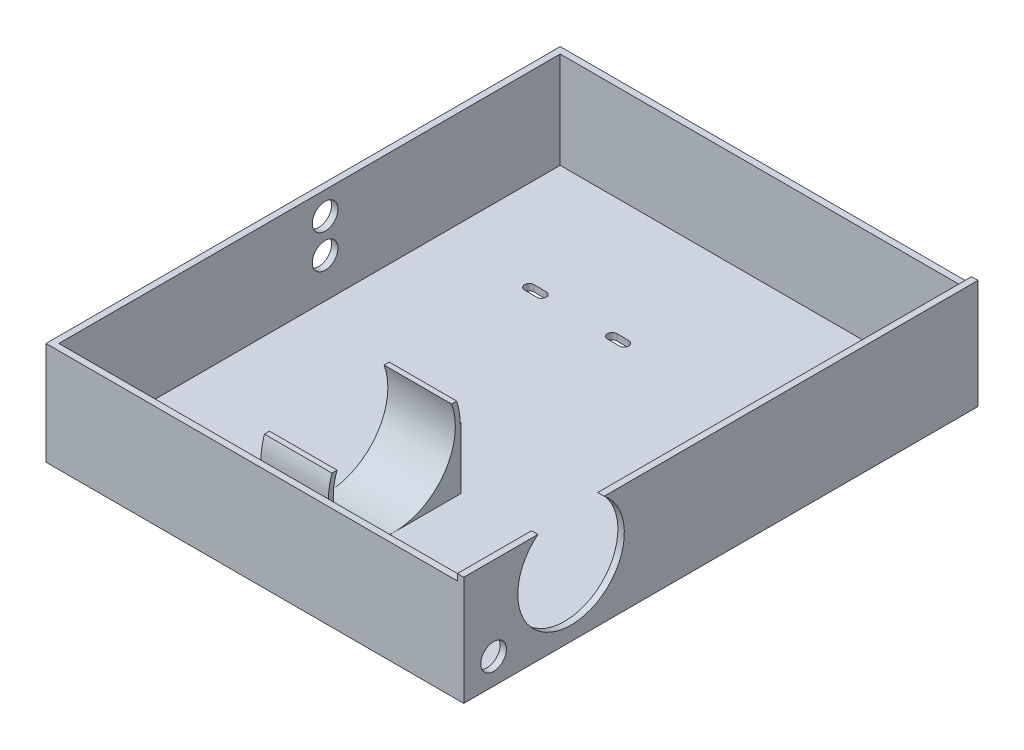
ISO-10303-21;
HEADER;
FILE_DESCRIPTION(('STEP AP214'),'2;1');
FILE_NAME('part.step','',(''),(''),'','','');
FILE_SCHEMA(('AUTOMOTIVE_DESIGN { 1 0 10303 214 1 1 1 1 }'));
ENDSEC;
DATA;
#1=APPLICATION_CONTEXT('core data for automotive mechanical design processes');
#2=APPLICATION_PROTOCOL_DEFINITION('international standard','automotive_design',2000,#1);
#3=PRODUCT_CONTEXT('',#1,'mechanical');
#4=PRODUCT('Part','Part','',(#3));
#5=PRODUCT_RELATED_PRODUCT_CATEGORY('part','',(#4));
#6=PRODUCT_DEFINITION_FORMATION('','',#4);
#7=PRODUCT_DEFINITION_CONTEXT('part definition',#1,'design');
#8=PRODUCT_DEFINITION('design','',#6,#7);
#9=PRODUCT_DEFINITION_SHAPE('','',#8);
#10=(LENGTH_UNIT() NAMED_UNIT(*) SI_UNIT(.MILLI.,.METRE.));
#11=(NAMED_UNIT(*) PLANE_ANGLE_UNIT() SI_UNIT($,.RADIAN.));
#12=(NAMED_UNIT(*) SI_UNIT($,.STERADIAN.) SOLID_ANGLE_UNIT());
#13=UNCERTAINTY_MEASURE_WITH_UNIT(LENGTH_MEASURE(1.E-05),#10,'distance_accuracy_value','');
#14=(GEOMETRIC_REPRESENTATION_CONTEXT(3) GLOBAL_UNCERTAINTY_ASSIGNED_CONTEXT((#13)) GLOBAL_UNIT_ASSIGNED_CONTEXT((#10,
#11,#12)) REPRESENTATION_CONTEXT('',''));
#15=CARTESIAN_POINT('',(0.,0.,0.));
#16=DIRECTION('',(0.,0.,1.));
#17=DIRECTION('',(1.,0.,0.));
#18=AXIS2_PLACEMENT_3D('',#15,#16,#17);
#19=CARTESIAN_POINT('',(0.,2.,0.));
#20=DIRECTION('',(0.,-1.,0.));
#21=DIRECTION('',(0.,0.,-1.));
#22=AXIS2_PLACEMENT_3D('',#19,#20,#21);
#23=PLANE('',#22);
#24=DIRECTION('',(0.,0.,1.));
#25=VECTOR('',#24,1.);
#26=CARTESIAN_POINT('',(54.,2.,0.));
#27=LINE('',#26,#25);
#28=CARTESIAN_POINT('',(54.,2.,-54.1969807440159));
#29=VERTEX_POINT('',#28);
#30=CARTESIAN_POINT('',(54.,2.00000000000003,-33.3714284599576));
#31=VERTEX_POINT('',#30);
#32=EDGE_CURVE('E314',#29,#31,#27,.T.);
#33=ORIENTED_EDGE('',*,*,#32,.F.);
#34=DIRECTION('',(1.,0.,0.));
#35=VECTOR('',#34,1.);
#36=CARTESIAN_POINT('',(54.,2.,-54.1969807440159));
#37=LINE('',#36,#35);
#38=CARTESIAN_POINT('',(75.,2.,-54.1969807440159));
#39=VERTEX_POINT('',#38);
#40=EDGE_CURVE('E382',#29,#39,#37,.T.);
#41=ORIENTED_EDGE('',*,*,#40,.T.);
#42=DIRECTION('',(0.,0.,1.));
#43=VECTOR('',#42,1.);
#44=CARTESIAN_POINT('',(75.,2.,0.));
#45=LINE('',#44,#43);
#46=CARTESIAN_POINT('',(75.,2.00000000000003,-33.3714284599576));
#47=VERTEX_POINT('',#46);
#48=EDGE_CURVE('E316',#39,#47,#45,.T.);
#49=ORIENTED_EDGE('',*,*,#48,.T.);
#50=CARTESIAN_POINT('',(75.,2.,-12.8714284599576));
#51=VERTEX_POINT('',#50);
#52=EDGE_CURVE('E313',#47,#51,#45,.T.);
#53=ORIENTED_EDGE('',*,*,#52,.T.);
#54=DIRECTION('',(1.,0.,0.));
#55=VECTOR('',#54,1.);
#56=CARTESIAN_POINT('',(54.,2.,-12.8714284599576));
#57=LINE('',#56,#55);
#58=CARTESIAN_POINT('',(54.,2.,-12.8714284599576));
#59=VERTEX_POINT('',#58);
#60=EDGE_CURVE('E394',#59,#51,#57,.T.);
#61=ORIENTED_EDGE('',*,*,#60,.F.);
#62=EDGE_CURVE('E311',#31,#59,#27,.T.);
#63=ORIENTED_EDGE('',*,*,#62,.F.);
#64=EDGE_LOOP('',(#33,#41,#49,#53,#61,#63));
#65=FACE_BOUND('',#64,.T.);
#66=DIRECTION('',(-0.999931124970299,0.,-0.0117364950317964));
#67=VECTOR('',#66,1.);
#68=CARTESIAN_POINT('',(33.9153525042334,2.,-121.75040197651));
#69=LINE('',#68,#67);
#70=CARTESIAN_POINT('',(33.9153525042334,2.,-121.75040197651));
#71=VERTEX_POINT('',#70);
#72=CARTESIAN_POINT('',(30.0909049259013,2.,-121.795290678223));
#73=VERTEX_POINT('',#72);
#74=EDGE_CURVE('E427',#71,#73,#69,.T.);
#75=ORIENTED_EDGE('',*,*,#74,.F.);
#76=CARTESIAN_POINT('',(33.8980985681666,2.,-120.280393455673));
#77=DIRECTION('',(0.,1.,0.));
#78=DIRECTION('',(0.,0.,1.));
#79=AXIS2_PLACEMENT_3D('',#76,#77,#78);
#80=CIRCLE('',#79,1.47010977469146);
#81=CARTESIAN_POINT('',(33.8808446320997,2.,-118.810384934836));
#82=VERTEX_POINT('',#81);
#83=EDGE_CURVE('E425',#82,#71,#80,.T.);
#84=ORIENTED_EDGE('',*,*,#83,.F.);
#85=DIRECTION('',(0.999931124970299,0.,0.0117364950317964));
#86=VECTOR('',#85,1.);
#87=CARTESIAN_POINT('',(33.8808446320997,2.,-118.810384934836));
#88=LINE('',#87,#86);
#89=CARTESIAN_POINT('',(30.0563970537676,2.,-118.855273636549));
#90=VERTEX_POINT('',#89);
#91=EDGE_CURVE('E434',#90,#82,#88,.T.);
#92=ORIENTED_EDGE('',*,*,#91,.F.);
#93=CARTESIAN_POINT('',(30.0736509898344,2.,-120.325282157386));
#94=DIRECTION('',(0.,1.,0.));
#95=DIRECTION('',(0.,0.,1.));
#96=AXIS2_PLACEMENT_3D('',#93,#94,#95);
#97=CIRCLE('',#96,1.47010977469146);
#98=EDGE_CURVE('E431',#73,#90,#97,.T.);
#99=ORIENTED_EDGE('',*,*,#98,.F.);
#100=EDGE_LOOP('',(#75,#84,#92,#99));
#101=FACE_BOUND('',#100,.T.);
#102=DIRECTION('',(-0.999931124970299,0.,-0.011736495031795));
#103=VECTOR('',#102,1.);
#104=CARTESIAN_POINT('',(59.9121793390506,2.,-121.440400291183));
#105=LINE('',#104,#103);
#106=CARTESIAN_POINT('',(59.9121793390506,2.,-121.440400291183));
#107=VERTEX_POINT('',#106);
#108=CARTESIAN_POINT('',(56.1906892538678,2.,-121.484080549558));
#109=VERTEX_POINT('',#108);
#110=EDGE_CURVE('E461',#107,#109,#105,.T.);
#111=ORIENTED_EDGE('',*,*,#110,.F.);
#112=CARTESIAN_POINT('',(59.8949825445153,2.,-119.975260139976));
#113=DIRECTION('',(0.,1.,0.));
#114=DIRECTION('',(0.,0.,1.));
#115=AXIS2_PLACEMENT_3D('',#112,#113,#114);
#116=CIRCLE('',#115,1.46524106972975);
#117=CARTESIAN_POINT('',(59.87778574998,2.,-118.510119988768));
#118=VERTEX_POINT('',#117);
#119=EDGE_CURVE('E428',#118,#107,#116,.T.);
#120=ORIENTED_EDGE('',*,*,#119,.F.);
#121=DIRECTION('',(0.999931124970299,0.,0.0117364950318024));
#122=VECTOR('',#121,1.);
#123=CARTESIAN_POINT('',(59.87778574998,2.,-118.510119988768));
#124=LINE('',#123,#122);
#125=CARTESIAN_POINT('',(56.1562956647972,2.,-118.553800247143));
#126=VERTEX_POINT('',#125);
#127=EDGE_CURVE('E450',#126,#118,#124,.T.);
#128=ORIENTED_EDGE('',*,*,#127,.F.);
#129=CARTESIAN_POINT('',(56.1734924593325,2.,-120.01894039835));
#130=DIRECTION('',(0.,1.,0.));
#131=DIRECTION('',(0.,0.,1.));
#132=AXIS2_PLACEMENT_3D('',#129,#130,#131);
#133=CIRCLE('',#132,1.46524106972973);
#134=EDGE_CURVE('E458',#109,#126,#133,.T.);
#135=ORIENTED_EDGE('',*,*,#134,.F.);
#136=EDGE_LOOP('',(#111,#120,#128,#135));
#137=FACE_BOUND('',#136,.T.);
#138=DIRECTION('',(1.,0.,0.));
#139=VECTOR('',#138,1.);
#140=CARTESIAN_POINT('',(2.,2.,-158.));
#141=LINE('',#140,#139);
#142=CARTESIAN_POINT('',(2.,2.,-158.));
#143=VERTEX_POINT('',#142);
#144=CARTESIAN_POINT('',(128.,2.,-158.));
#145=VERTEX_POINT('',#144);
#146=EDGE_CURVE('E252',#143,#145,#141,.T.);
#147=ORIENTED_EDGE('',*,*,#146,.F.);
#148=DIRECTION('',(0.,0.,-1.));
#149=VECTOR('',#148,1.);
#150=CARTESIAN_POINT('',(2.,2.,-160.));
#151=LINE('',#150,#149);
#152=CARTESIAN_POINT('',(2.00000000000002,2.,-1.99999999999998));
#153=VERTEX_POINT('',#152);
#154=EDGE_CURVE('E261',#153,#143,#151,.T.);
#155=ORIENTED_EDGE('',*,*,#154,.F.);
#156=DIRECTION('',(-1.,0.,0.));
#157=VECTOR('',#156,1.);
#158=CARTESIAN_POINT('',(128.,2.,-2.));
#159=LINE('',#158,#157);
#160=CARTESIAN_POINT('',(128.,2.,-2.));
#161=VERTEX_POINT('',#160);
#162=EDGE_CURVE('E262',#161,#153,#159,.T.);
#163=ORIENTED_EDGE('',*,*,#162,.F.);
#164=DIRECTION('',(0.,0.,1.));
#165=VECTOR('',#164,1.);
#166=CARTESIAN_POINT('',(128.,2.,0.));
#167=LINE('',#166,#165);
#168=EDGE_CURVE('E336',#145,#161,#167,.T.);
#169=ORIENTED_EDGE('',*,*,#168,.F.);
#170=EDGE_LOOP('',(#147,#155,#163,#169));
#171=FACE_BOUND('',#170,.T.);
#172=ADVANCED_FACE('F43',(#65,#101,#137,#171),#23,.F.);
#173=CARTESIAN_POINT('',(2.,32.,-160.));
#174=DIRECTION('',(-1.,0.,0.));
#175=DIRECTION('',(0.,0.,1.));
#176=AXIS2_PLACEMENT_3D('',#173,#174,#175);
#177=PLANE('',#176);
#178=CARTESIAN_POINT('',(2.00000000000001,24.843091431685,-84.8541135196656));
#179=DIRECTION('',(1.,0.,0.));
#180=DIRECTION('',(0.,0.,-1.));
#181=AXIS2_PLACEMENT_3D('',#178,#179,#180);
#182=CIRCLE('',#181,4.00000000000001);
#183=CARTESIAN_POINT('',(2.00000000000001,24.843091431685,-88.8541135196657));
#184=VERTEX_POINT('',#183);
#185=EDGE_CURVE('E465',#184,#184,#182,.T.);
#186=ORIENTED_EDGE('',*,*,#185,.F.);
#187=EDGE_LOOP('',(#186));
#188=FACE_BOUND('',#187,.T.);
#189=CARTESIAN_POINT('',(2.00000000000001,14.3099296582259,-84.8541135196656));
#190=DIRECTION('',(1.,0.,0.));
#191=DIRECTION('',(0.,0.,-1.));
#192=AXIS2_PLACEMENT_3D('',#189,#190,#191);
#193=CIRCLE('',#192,4.00000000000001);
#194=CARTESIAN_POINT('',(2.00000000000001,14.3099296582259,-88.8541135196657));
#195=VERTEX_POINT('',#194);
#196=EDGE_CURVE('E440',#195,#195,#193,.T.);
#197=ORIENTED_EDGE('',*,*,#196,.F.);
#198=EDGE_LOOP('',(#197));
#199=FACE_BOUND('',#198,.T.);
#200=CARTESIAN_POINT('',(2.00000000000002,14.4124588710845,-13.8608746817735));
#201=DIRECTION('',(-1.,0.,0.));
#202=DIRECTION('',(0.,0.,1.));
#203=AXIS2_PLACEMENT_3D('',#200,#201,#202);
#204=CIRCLE('',#203,3.90573086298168);
#205=CARTESIAN_POINT('',(2.00000000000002,14.4124588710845,-9.95514381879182));
#206=VERTEX_POINT('',#205);
#207=EDGE_CURVE('E277',#206,#206,#204,.T.);
#208=ORIENTED_EDGE('',*,*,#207,.T.);
#209=EDGE_LOOP('',(#208));
#210=FACE_BOUND('',#209,.T.);
#211=DIRECTION('',(0.,-1.,0.));
#212=VECTOR('',#211,1.);
#213=CARTESIAN_POINT('',(2.,32.,-158.));
#214=LINE('',#213,#212);
#215=CARTESIAN_POINT('',(2.,32.,-158.));
#216=VERTEX_POINT('',#215);
#217=EDGE_CURVE('E244',#216,#143,#214,.T.);
#218=ORIENTED_EDGE('',*,*,#217,.F.);
#219=DIRECTION('',(0.,0.,-1.));
#220=VECTOR('',#219,1.);
#221=CARTESIAN_POINT('',(2.,32.,-160.));
#222=LINE('',#221,#220);
#223=CARTESIAN_POINT('',(2.00000000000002,32.,-1.99999999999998));
#224=VERTEX_POINT('',#223);
#225=EDGE_CURVE('E259',#224,#216,#222,.T.);
#226=ORIENTED_EDGE('',*,*,#225,.F.);
#227=DIRECTION('',(0.,-1.,0.));
#228=VECTOR('',#227,1.);
#229=CARTESIAN_POINT('',(2.00000000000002,32.,-1.99999999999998));
#230=LINE('',#229,#228);
#231=EDGE_CURVE('E488',#224,#153,#230,.T.);
#232=ORIENTED_EDGE('',*,*,#231,.T.);
#233=ORIENTED_EDGE('',*,*,#154,.T.);
#234=EDGE_LOOP('',(#218,#226,#232,#233));
#235=FACE_BOUND('',#234,.T.);
#236=ADVANCED_FACE('F257',(#188,#199,#210,#235),#177,.F.);
#237=CARTESIAN_POINT('',(128.,34.,0.));
#238=DIRECTION('',(1.,0.,0.));
#239=DIRECTION('',(0.,0.,-1.));
#240=AXIS2_PLACEMENT_3D('',#237,#238,#239);
#241=PLANE('',#240);
#242=CARTESIAN_POINT('',(128.,8.,-9.27264860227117));
#243=DIRECTION('',(1.,0.,0.));
#244=DIRECTION('',(0.,0.,-1.));
#245=AXIS2_PLACEMENT_3D('',#242,#243,#244);
#246=CIRCLE('',#245,4.);
#247=CARTESIAN_POINT('',(128.,8.,-13.2726486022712));
#248=VERTEX_POINT('',#247);
#249=EDGE_CURVE('E47',#248,#248,#246,.T.);
#250=ORIENTED_EDGE('',*,*,#249,.T.);
#251=EDGE_LOOP('',(#250));
#252=FACE_BOUND('',#251,.T.);
#253=DIRECTION('',(0.,-1.,0.));
#254=VECTOR('',#253,1.);
#255=CARTESIAN_POINT('',(128.,32.,-158.));
#256=LINE('',#255,#254);
#257=CARTESIAN_POINT('',(128.,32.,-158.));
#258=VERTEX_POINT('',#257);
#259=EDGE_CURVE('E247',#258,#145,#256,.T.);
#260=ORIENTED_EDGE('',*,*,#259,.T.);
#261=ORIENTED_EDGE('',*,*,#168,.T.);
#262=DIRECTION('',(0.,-1.,0.));
#263=VECTOR('',#262,1.);
#264=CARTESIAN_POINT('',(128.,32.,-2.));
#265=LINE('',#264,#263);
#266=CARTESIAN_POINT('',(128.,32.,-2.));
#267=VERTEX_POINT('',#266);
#268=EDGE_CURVE('E486',#267,#161,#265,.T.);
#269=ORIENTED_EDGE('',*,*,#268,.F.);
#270=DIRECTION('',(0.,0.,-1.));
#271=VECTOR('',#270,1.);
#272=CARTESIAN_POINT('',(128.,32.,0.));
#273=LINE('',#272,#271);
#274=CARTESIAN_POINT('',(128.,32.,0.));
#275=VERTEX_POINT('',#274);
#276=EDGE_CURVE('E484',#275,#267,#273,.T.);
#277=ORIENTED_EDGE('',*,*,#276,.F.);
#278=DIRECTION('',(0.,-1.,0.));
#279=VECTOR('',#278,1.);
#280=CARTESIAN_POINT('',(128.,34.,0.));
#281=LINE('',#280,#279);
#282=CARTESIAN_POINT('',(128.,34.,0.));
#283=VERTEX_POINT('',#282);
#284=EDGE_CURVE('E345',#283,#275,#281,.T.);
#285=ORIENTED_EDGE('',*,*,#284,.F.);
#286=DIRECTION('',(0.,0.,1.));
#287=VECTOR('',#286,1.);
#288=CARTESIAN_POINT('',(128.,34.,0.));
#289=LINE('',#288,#287);
#290=CARTESIAN_POINT('',(128.,34.,-23.0840785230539));
#291=VERTEX_POINT('',#290);
#292=EDGE_CURVE('E335',#291,#283,#289,.T.);
#293=ORIENTED_EDGE('',*,*,#292,.F.);
#294=CARTESIAN_POINT('',(128.,21.0000000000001,-33.3714284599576));
#295=DIRECTION('',(1.,0.,0.));
#296=DIRECTION('',(0.,0.,-1.));
#297=AXIS2_PLACEMENT_3D('',#294,#295,#296);
#298=CIRCLE('',#297,16.5779844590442);
#299=CARTESIAN_POINT('',(128.,34.,-43.6587783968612));
#300=VERTEX_POINT('',#299);
#301=EDGE_CURVE('E323',#291,#300,#298,.T.);
#302=ORIENTED_EDGE('',*,*,#301,.T.);
#303=CARTESIAN_POINT('',(128.,34.,-160.));
#304=VERTEX_POINT('',#303);
#305=EDGE_CURVE('E333',#304,#300,#289,.T.);
#306=ORIENTED_EDGE('',*,*,#305,.F.);
#307=DIRECTION('',(0.,-1.,0.));
#308=VECTOR('',#307,1.);
#309=CARTESIAN_POINT('',(128.,34.,-160.));
#310=LINE('',#309,#308);
#311=CARTESIAN_POINT('',(128.,32.,-160.));
#312=VERTEX_POINT('',#311);
#313=EDGE_CURVE('E354',#304,#312,#310,.T.);
#314=ORIENTED_EDGE('',*,*,#313,.T.);
#315=DIRECTION('',(0.,0.,-1.));
#316=VECTOR('',#315,1.);
#317=CARTESIAN_POINT('',(128.,32.,-160.));
#318=LINE('',#317,#316);
#319=EDGE_CURVE('E251',#258,#312,#318,.T.);
#320=ORIENTED_EDGE('',*,*,#319,.F.);
#321=EDGE_LOOP('',(#260,#261,#269,#277,#285,#293,#302,#306,#314,#320));
#322=FACE_BOUND('',#321,.T.);
#323=ADVANCED_FACE('F331',(#252,#322),#241,.F.);
#324=CARTESIAN_POINT('',(0.,34.,0.));
#325=DIRECTION('',(0.,1.,0.));
#326=DIRECTION('',(0.,0.,1.));
#327=AXIS2_PLACEMENT_3D('',#324,#325,#326);
#328=PLANE('',#327);
#329=DIRECTION('',(1.,0.,0.));
#330=VECTOR('',#329,1.);
#331=CARTESIAN_POINT('',(98.,34.,-23.0840785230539));
#332=LINE('',#331,#330);
#333=CARTESIAN_POINT('',(130.,34.,-23.0840785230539));
#334=VERTEX_POINT('',#333);
#335=EDGE_CURVE('E11',#291,#334,#332,.T.);
#336=ORIENTED_EDGE('',*,*,#335,.F.);
#337=ORIENTED_EDGE('',*,*,#292,.T.);
#338=DIRECTION('',(1.,0.,0.));
#339=VECTOR('',#338,1.);
#340=CARTESIAN_POINT('',(130.,34.,0.));
#341=LINE('',#340,#339);
#342=CARTESIAN_POINT('',(130.,34.,0.));
#343=VERTEX_POINT('',#342);
#344=EDGE_CURVE('E342',#283,#343,#341,.T.);
#345=ORIENTED_EDGE('',*,*,#344,.T.);
#346=DIRECTION('',(0.,0.,-1.));
#347=VECTOR('',#346,1.);
#348=CARTESIAN_POINT('',(130.,34.,0.));
#349=LINE('',#348,#347);
#350=EDGE_CURVE('E498',#343,#334,#349,.T.);
#351=ORIENTED_EDGE('',*,*,#350,.T.);
#352=EDGE_LOOP('',(#336,#337,#345,#351));
#353=FACE_BOUND('',#352,.T.);
#354=ADVANCED_FACE('F645',(#353),#328,.T.);
#355=CARTESIAN_POINT('',(75.,21.0000000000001,-33.3714284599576));
#356=DIRECTION('',(-1.,0.,0.));
#357=DIRECTION('',(0.,0.,1.));
#358=AXIS2_PLACEMENT_3D('',#355,#356,#357);
#359=CYLINDRICAL_SURFACE('',#358,20.5);
#360=CARTESIAN_POINT('',(75.,21.0000000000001,-33.3714284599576));
#361=DIRECTION('',(1.,0.,0.));
#362=DIRECTION('',(0.,0.,-1.));
#363=AXIS2_PLACEMENT_3D('',#360,#361,#362);
#364=CIRCLE('',#363,20.5);
#365=CARTESIAN_POINT('',(75.,27.5927472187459,-13.9604603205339));
#366=VERTEX_POINT('',#365);
#367=CARTESIAN_POINT('',(75.,20.9999999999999,-12.8714284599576));
#368=VERTEX_POINT('',#367);
#369=EDGE_CURVE('E413',#366,#368,#364,.T.);
#370=ORIENTED_EDGE('',*,*,#369,.F.);
#371=DIRECTION('',(-1.,0.,0.));
#372=VECTOR('',#371,1.);
#373=CARTESIAN_POINT('',(75.,27.5927472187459,-13.9604603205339));
#374=LINE('',#373,#372);
#375=CARTESIAN_POINT('',(54.,27.5927472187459,-13.9604603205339));
#376=VERTEX_POINT('',#375);
#377=EDGE_CURVE('E366',#366,#376,#374,.T.);
#378=ORIENTED_EDGE('',*,*,#377,.T.);
#379=CARTESIAN_POINT('',(54.,21.0000000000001,-33.3714284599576));
#380=DIRECTION('',(1.,0.,0.));
#381=DIRECTION('',(0.,0.,-1.));
#382=AXIS2_PLACEMENT_3D('',#379,#380,#381);
#383=CIRCLE('',#382,20.5);
#384=CARTESIAN_POINT('',(54.,20.9999999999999,-12.8714284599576));
#385=VERTEX_POINT('',#384);
#386=EDGE_CURVE('E404',#376,#385,#383,.T.);
#387=ORIENTED_EDGE('',*,*,#386,.T.);
#388=DIRECTION('',(1.,0.,0.));
#389=VECTOR('',#388,1.);
#390=CARTESIAN_POINT('',(54.,20.9999999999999,-12.8714284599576));
#391=LINE('',#390,#389);
#392=EDGE_CURVE('E380',#385,#368,#391,.T.);
#393=ORIENTED_EDGE('',*,*,#392,.T.);
#394=EDGE_LOOP('',(#370,#378,#387,#393));
#395=FACE_BOUND('',#394,.T.);
#396=ADVANCED_FACE('F554',(#395),#359,.T.);
#397=CARTESIAN_POINT('',(75.,21.0000000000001,-33.3714284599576));
#398=DIRECTION('',(1.,0.,0.));
#399=DIRECTION('',(0.,0.,-1.));
#400=AXIS2_PLACEMENT_3D('',#397,#398,#399);
#401=PLANE('',#400);
#402=DIRECTION('',(0.,0.,-1.));
#403=VECTOR('',#402,1.);
#404=CARTESIAN_POINT('',(75.,27.5927472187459,-55.4478886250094));
#405=LINE('',#404,#403);
#406=CARTESIAN_POINT('',(75.,27.5927472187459,-15.5518974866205));
#407=VERTEX_POINT('',#406);
#408=EDGE_CURVE('E361',#366,#407,#405,.T.);
#409=ORIENTED_EDGE('',*,*,#408,.F.);
#410=ORIENTED_EDGE('',*,*,#369,.T.);
#411=DIRECTION('',(0.,-1.,0.));
#412=VECTOR('',#411,1.);
#413=CARTESIAN_POINT('',(75.,0.,-12.8714284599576));
#414=LINE('',#413,#412);
#415=EDGE_CURVE('E369',#368,#51,#414,.T.);
#416=ORIENTED_EDGE('',*,*,#415,.T.);
#417=ORIENTED_EDGE('',*,*,#52,.F.);
#418=CARTESIAN_POINT('',(75.,21.0000000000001,-33.3714284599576));
#419=DIRECTION('',(1.,0.,0.));
#420=DIRECTION('',(0.,0.,-1.));
#421=AXIS2_PLACEMENT_3D('',#418,#419,#420);
#422=CIRCLE('',#421,19.);
#423=EDGE_CURVE('E405',#407,#47,#422,.T.);
#424=ORIENTED_EDGE('',*,*,#423,.F.);
#425=EDGE_LOOP('',(#409,#410,#416,#417,#424));
#426=FACE_BOUND('',#425,.T.);
#427=ADVANCED_FACE('F622',(#426),#401,.T.);
#428=CARTESIAN_POINT('',(54.,21.0000000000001,-33.3714284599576));
#429=DIRECTION('',(1.,0.,0.));
#430=DIRECTION('',(0.,0.,-1.));
#431=AXIS2_PLACEMENT_3D('',#428,#429,#430);
#432=PLANE('',#431);
#433=ORIENTED_EDGE('',*,*,#386,.F.);
#434=DIRECTION('',(0.,0.,-1.));
#435=VECTOR('',#434,1.);
#436=CARTESIAN_POINT('',(54.,27.5927472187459,-55.4478886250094));
#437=LINE('',#436,#435);
#438=CARTESIAN_POINT('',(54.,27.5927472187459,-15.5518974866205));
#439=VERTEX_POINT('',#438);
#440=EDGE_CURVE('E360',#376,#439,#437,.T.);
#441=ORIENTED_EDGE('',*,*,#440,.T.);
#442=CARTESIAN_POINT('',(54.,21.0000000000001,-33.3714284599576));
#443=DIRECTION('',(1.,0.,0.));
#444=DIRECTION('',(0.,0.,-1.));
#445=AXIS2_PLACEMENT_3D('',#442,#443,#444);
#446=CIRCLE('',#445,19.);
#447=EDGE_CURVE('E385',#439,#31,#446,.T.);
#448=ORIENTED_EDGE('',*,*,#447,.T.);
#449=ORIENTED_EDGE('',*,*,#62,.T.);
#450=DIRECTION('',(0.,-1.,0.));
#451=VECTOR('',#450,1.);
#452=CARTESIAN_POINT('',(54.,0.,-12.8714284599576));
#453=LINE('',#452,#451);
#454=EDGE_CURVE('E391',#385,#59,#453,.T.);
#455=ORIENTED_EDGE('',*,*,#454,.F.);
#456=EDGE_LOOP('',(#433,#441,#448,#449,#455));
#457=FACE_BOUND('',#456,.T.);
#458=ADVANCED_FACE('F551',(#457),#432,.F.);
#459=CARTESIAN_POINT('',(54.,21.0000000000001,-53.8714284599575));
#460=VERTEX_POINT('',#459);
#461=CARTESIAN_POINT('',(54.,27.5927472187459,-52.7823965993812));
#462=VERTEX_POINT('',#461);
#463=EDGE_CURVE('E414',#460,#462,#383,.T.);
#464=ORIENTED_EDGE('',*,*,#463,.T.);
#465=DIRECTION('',(-1.,0.,0.));
#466=VECTOR('',#465,1.);
#467=CARTESIAN_POINT('',(75.,27.5927472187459,-52.7823965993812));
#468=LINE('',#467,#466);
#469=CARTESIAN_POINT('',(75.,27.5927472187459,-52.7823965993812));
#470=VERTEX_POINT('',#469);
#471=EDGE_CURVE('E363',#462,#470,#468,.F.);
#472=ORIENTED_EDGE('',*,*,#471,.T.);
#473=CARTESIAN_POINT('',(75.,21.0000000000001,-53.8714284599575));
#474=VERTEX_POINT('',#473);
#475=EDGE_CURVE('E409',#474,#470,#364,.T.);
#476=ORIENTED_EDGE('',*,*,#475,.F.);
#477=DIRECTION('',(1.,0.,0.));
#478=VECTOR('',#477,1.);
#479=CARTESIAN_POINT('',(54.,21.0000000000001,-53.8714284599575));
#480=LINE('',#479,#478);
#481=EDGE_CURVE('E386',#460,#474,#480,.T.);
#482=ORIENTED_EDGE('',*,*,#481,.F.);
#483=EDGE_LOOP('',(#464,#472,#476,#482));
#484=FACE_BOUND('',#483,.T.);
#485=ADVANCED_FACE('F544',(#484),#359,.T.);
#486=CARTESIAN_POINT('',(0.,2.,0.));
#487=DIRECTION('',(1.,0.,0.));
#488=DIRECTION('',(0.,0.,-1.));
#489=AXIS2_PLACEMENT_3D('',#486,#487,#488);
#490=PLANE('',#489);
#491=CARTESIAN_POINT('',(0.,24.843091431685,-84.8541135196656));
#492=DIRECTION('',(1.,0.,0.));
#493=DIRECTION('',(0.,0.,-1.));
#494=AXIS2_PLACEMENT_3D('',#491,#492,#493);
#495=CIRCLE('',#494,4.00000000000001);
#496=CARTESIAN_POINT('',(0.,24.843091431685,-88.8541135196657));
#497=VERTEX_POINT('',#496);
#498=EDGE_CURVE('E473',#497,#497,#495,.T.);
#499=ORIENTED_EDGE('',*,*,#498,.T.);
#500=EDGE_LOOP('',(#499));
#501=FACE_BOUND('',#500,.T.);
#502=CARTESIAN_POINT('',(0.,14.3099296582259,-84.8541135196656));
#503=DIRECTION('',(1.,0.,0.));
#504=DIRECTION('',(0.,0.,-1.));
#505=AXIS2_PLACEMENT_3D('',#502,#503,#504);
#506=CIRCLE('',#505,4.00000000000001);
#507=CARTESIAN_POINT('',(0.,14.3099296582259,-88.8541135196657));
#508=VERTEX_POINT('',#507);
#509=EDGE_CURVE('E468',#508,#508,#506,.T.);
#510=ORIENTED_EDGE('',*,*,#509,.T.);
#511=EDGE_LOOP('',(#510));
#512=FACE_BOUND('',#511,.T.);
#513=CARTESIAN_POINT('',(0.,14.4124588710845,-13.8608746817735));
#514=DIRECTION('',(-1.,0.,0.));
#515=DIRECTION('',(0.,0.,1.));
#516=AXIS2_PLACEMENT_3D('',#513,#514,#515);
#517=CIRCLE('',#516,3.90573086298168);
#518=CARTESIAN_POINT('',(0.,14.4124588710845,-9.95514381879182));
#519=VERTEX_POINT('',#518);
#520=EDGE_CURVE('E293',#519,#519,#517,.T.);
#521=ORIENTED_EDGE('',*,*,#520,.F.);
#522=EDGE_LOOP('',(#521));
#523=FACE_BOUND('',#522,.T.);
#524=DIRECTION('',(0.,0.,1.));
#525=VECTOR('',#524,1.);
#526=CARTESIAN_POINT('',(0.,0.,0.));
#527=LINE('',#526,#525);
#528=CARTESIAN_POINT('',(0.,0.,-160.));
#529=VERTEX_POINT('',#528);
#530=CARTESIAN_POINT('',(0.,0.,0.));
#531=VERTEX_POINT('',#530);
#532=EDGE_CURVE('E282',#529,#531,#527,.T.);
#533=ORIENTED_EDGE('',*,*,#532,.T.);
#534=DIRECTION('',(0.,-1.,0.));
#535=VECTOR('',#534,1.);
#536=CARTESIAN_POINT('',(0.,2.,0.));
#537=LINE('',#536,#535);
#538=CARTESIAN_POINT('',(0.,32.,0.));
#539=VERTEX_POINT('',#538);
#540=EDGE_CURVE('E287',#539,#531,#537,.T.);
#541=ORIENTED_EDGE('',*,*,#540,.F.);
#542=DIRECTION('',(0.,0.,1.));
#543=VECTOR('',#542,1.);
#544=CARTESIAN_POINT('',(0.,32.,-160.));
#545=LINE('',#544,#543);
#546=CARTESIAN_POINT('',(0.,32.,-160.));
#547=VERTEX_POINT('',#546);
#548=EDGE_CURVE('E272',#547,#539,#545,.T.);
#549=ORIENTED_EDGE('',*,*,#548,.F.);
#550=DIRECTION('',(0.,1.,0.));
#551=VECTOR('',#550,1.);
#552=CARTESIAN_POINT('',(0.,0.,-160.));
#553=LINE('',#552,#551);
#554=EDGE_CURVE('E280',#529,#547,#553,.T.);
#555=ORIENTED_EDGE('',*,*,#554,.F.);
#556=EDGE_LOOP('',(#533,#541,#549,#555));
#557=FACE_BOUND('',#556,.T.);
#558=ADVANCED_FACE('F45',(#501,#512,#523,#557),#490,.F.);
#559=CARTESIAN_POINT('',(0.,2.,0.));
#560=DIRECTION('',(0.,0.,-1.));
#561=DIRECTION('',(-1.,0.,0.));
#562=AXIS2_PLACEMENT_3D('',#559,#560,#561);
#563=PLANE('',#562);
#564=DIRECTION('',(1.,0.,0.));
#565=VECTOR('',#564,1.);
#566=CARTESIAN_POINT('',(0.,0.,0.));
#567=LINE('',#566,#565);
#568=CARTESIAN_POINT('',(130.,0.,0.));
#569=VERTEX_POINT('',#568);
#570=EDGE_CURVE('E285',#531,#569,#567,.T.);
#571=ORIENTED_EDGE('',*,*,#570,.T.);
#572=DIRECTION('',(0.,1.,0.));
#573=VECTOR('',#572,1.);
#574=CARTESIAN_POINT('',(130.,0.,0.));
#575=LINE('',#574,#573);
#576=EDGE_CURVE('E419',#569,#343,#575,.T.);
#577=ORIENTED_EDGE('',*,*,#576,.T.);
#578=ORIENTED_EDGE('',*,*,#344,.F.);
#579=ORIENTED_EDGE('',*,*,#284,.T.);
#580=DIRECTION('',(1.,0.,0.));
#581=VECTOR('',#580,1.);
#582=CARTESIAN_POINT('',(0.,32.,0.));
#583=LINE('',#582,#581);
#584=EDGE_CURVE('E59',#539,#275,#583,.T.);
#585=ORIENTED_EDGE('',*,*,#584,.F.);
#586=ORIENTED_EDGE('',*,*,#540,.T.);
#587=EDGE_LOOP('',(#571,#577,#578,#579,#585,#586));
#588=FACE_BOUND('',#587,.T.);
#589=ADVANCED_FACE('F481',(#588),#563,.F.);
#590=CARTESIAN_POINT('',(0.,0.,0.));
#591=DIRECTION('',(0.,-1.,0.));
#592=DIRECTION('',(0.,0.,-1.));
#593=AXIS2_PLACEMENT_3D('',#590,#591,#592);
#594=PLANE('',#593);
#595=CARTESIAN_POINT('',(33.8980985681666,0.,-120.280393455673));
#596=DIRECTION('',(0.,-1.,0.));
#597=DIRECTION('',(0.,0.,-1.));
#598=AXIS2_PLACEMENT_3D('',#595,#596,#597);
#599=CIRCLE('',#598,1.47010977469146);
#600=CARTESIAN_POINT('',(33.9153525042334,0.,-121.75040197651));
#601=VERTEX_POINT('',#600);
#602=CARTESIAN_POINT('',(33.8808446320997,0.,-118.810384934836));
#603=VERTEX_POINT('',#602);
#604=EDGE_CURVE('E309',#601,#603,#599,.T.);
#605=ORIENTED_EDGE('',*,*,#604,.F.);
#606=DIRECTION('',(0.999931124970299,0.,0.0117364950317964));
#607=VECTOR('',#606,1.);
#608=CARTESIAN_POINT('',(1.43349625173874,0.,-122.131651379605));
#609=LINE('',#608,#607);
#610=CARTESIAN_POINT('',(30.0909049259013,0.,-121.795290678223));
#611=VERTEX_POINT('',#610);
#612=EDGE_CURVE('E302',#611,#601,#609,.T.);
#613=ORIENTED_EDGE('',*,*,#612,.F.);
#614=CARTESIAN_POINT('',(30.0736509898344,0.,-120.325282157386));
#615=DIRECTION('',(0.,-1.,0.));
#616=DIRECTION('',(0.,0.,-1.));
#617=AXIS2_PLACEMENT_3D('',#614,#615,#616);
#618=CIRCLE('',#617,1.47010977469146);
#619=CARTESIAN_POINT('',(30.0563970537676,0.,-118.855273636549));
#620=VERTEX_POINT('',#619);
#621=EDGE_CURVE('E304',#620,#611,#618,.T.);
#622=ORIENTED_EDGE('',*,*,#621,.F.);
#623=DIRECTION('',(-0.999931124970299,0.,-0.0117364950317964));
#624=VECTOR('',#623,1.);
#625=CARTESIAN_POINT('',(1.39898837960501,0.,-119.19163433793));
#626=LINE('',#625,#624);
#627=EDGE_CURVE('E307',#603,#620,#626,.T.);
#628=ORIENTED_EDGE('',*,*,#627,.F.);
#629=EDGE_LOOP('',(#605,#613,#622,#628));
#630=FACE_BOUND('',#629,.T.);
#631=CARTESIAN_POINT('',(59.8949825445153,0.,-119.975260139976));
#632=DIRECTION('',(0.,-1.,0.));
#633=DIRECTION('',(0.,0.,-1.));
#634=AXIS2_PLACEMENT_3D('',#631,#632,#633);
#635=CIRCLE('',#634,1.46524106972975);
#636=CARTESIAN_POINT('',(59.9121793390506,0.,-121.440400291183));
#637=VERTEX_POINT('',#636);
#638=CARTESIAN_POINT('',(59.87778574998,0.,-118.510119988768));
#639=VERTEX_POINT('',#638);
#640=EDGE_CURVE('E300',#637,#639,#635,.T.);
#641=ORIENTED_EDGE('',*,*,#640,.F.);
#642=DIRECTION('',(0.999931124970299,0.,0.011736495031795));
#643=VECTOR('',#642,1.);
#644=CARTESIAN_POINT('',(1.43343911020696,0.,-122.126783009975));
#645=LINE('',#644,#643);
#646=CARTESIAN_POINT('',(56.1906892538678,0.,-121.484080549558));
#647=VERTEX_POINT('',#646);
#648=EDGE_CURVE('E290',#647,#637,#645,.T.);
#649=ORIENTED_EDGE('',*,*,#648,.F.);
#650=CARTESIAN_POINT('',(56.1734924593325,0.,-120.01894039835));
#651=DIRECTION('',(0.,-1.,0.));
#652=DIRECTION('',(0.,0.,-1.));
#653=AXIS2_PLACEMENT_3D('',#650,#651,#652);
#654=CIRCLE('',#653,1.46524106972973);
#655=CARTESIAN_POINT('',(56.1562956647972,0.,-118.553800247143));
#656=VERTEX_POINT('',#655);
#657=EDGE_CURVE('E295',#656,#647,#654,.T.);
#658=ORIENTED_EDGE('',*,*,#657,.F.);
#659=DIRECTION('',(-0.999931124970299,0.,-0.0117364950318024));
#660=VECTOR('',#659,1.);
#661=CARTESIAN_POINT('',(1.39904552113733,0.,-119.19650270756));
#662=LINE('',#661,#660);
#663=EDGE_CURVE('E298',#639,#656,#662,.T.);
#664=ORIENTED_EDGE('',*,*,#663,.F.);
#665=EDGE_LOOP('',(#641,#649,#658,#664));
#666=FACE_BOUND('',#665,.T.);
#667=ORIENTED_EDGE('',*,*,#532,.F.);
#668=DIRECTION('',(-1.,0.,0.));
#669=VECTOR('',#668,1.);
#670=CARTESIAN_POINT('',(100.,0.,-160.));
#671=LINE('',#670,#669);
#672=CARTESIAN_POINT('',(130.,0.,-160.));
#673=VERTEX_POINT('',#672);
#674=EDGE_CURVE('E270',#673,#529,#671,.T.);
#675=ORIENTED_EDGE('',*,*,#674,.F.);
#676=DIRECTION('',(0.,0.,-1.));
#677=VECTOR('',#676,1.);
#678=CARTESIAN_POINT('',(130.,0.,0.));
#679=LINE('',#678,#677);
#680=EDGE_CURVE('E412',#569,#673,#679,.T.);
#681=ORIENTED_EDGE('',*,*,#680,.F.);
#682=ORIENTED_EDGE('',*,*,#570,.F.);
#683=EDGE_LOOP('',(#667,#675,#681,#682));
#684=FACE_BOUND('',#683,.T.);
#685=ADVANCED_FACE('F538',(#630,#666,#684),#594,.T.);
#686=CARTESIAN_POINT('',(100.,0.,-160.));
#687=DIRECTION('',(0.,0.,-1.));
#688=DIRECTION('',(-1.,0.,0.));
#689=AXIS2_PLACEMENT_3D('',#686,#687,#688);
#690=PLANE('',#689);
#691=DIRECTION('',(-1.,0.,0.));
#692=VECTOR('',#691,1.);
#693=CARTESIAN_POINT('',(0.,32.,-160.));
#694=LINE('',#693,#692);
#695=EDGE_CURVE('E267',#312,#547,#694,.T.);
#696=ORIENTED_EDGE('',*,*,#695,.F.);
#697=ORIENTED_EDGE('',*,*,#313,.F.);
#698=DIRECTION('',(-1.,0.,0.));
#699=VECTOR('',#698,1.);
#700=CARTESIAN_POINT('',(130.,34.,-160.));
#701=LINE('',#700,#699);
#702=CARTESIAN_POINT('',(130.,34.,-160.));
#703=VERTEX_POINT('',#702);
#704=EDGE_CURVE('E340',#703,#304,#701,.T.);
#705=ORIENTED_EDGE('',*,*,#704,.F.);
#706=DIRECTION('',(0.,1.,0.));
#707=VECTOR('',#706,1.);
#708=CARTESIAN_POINT('',(130.,0.,-160.));
#709=LINE('',#708,#707);
#710=EDGE_CURVE('E420',#673,#703,#709,.T.);
#711=ORIENTED_EDGE('',*,*,#710,.F.);
#712=ORIENTED_EDGE('',*,*,#674,.T.);
#713=ORIENTED_EDGE('',*,*,#554,.T.);
#714=EDGE_LOOP('',(#696,#697,#705,#711,#712,#713));
#715=FACE_BOUND('',#714,.T.);
#716=ADVANCED_FACE('F508',(#715),#690,.T.);
#717=CARTESIAN_POINT('',(0.,32.,0.));
#718=DIRECTION('',(0.,1.,0.));
#719=DIRECTION('',(0.,0.,1.));
#720=AXIS2_PLACEMENT_3D('',#717,#718,#719);
#721=PLANE('',#720);
#722=ORIENTED_EDGE('',*,*,#548,.T.);
#723=ORIENTED_EDGE('',*,*,#584,.T.);
#724=ORIENTED_EDGE('',*,*,#276,.T.);
#725=DIRECTION('',(-1.,0.,0.));
#726=VECTOR('',#725,1.);
#727=CARTESIAN_POINT('',(128.,32.,-2.));
#728=LINE('',#727,#726);
#729=EDGE_CURVE('E265',#267,#224,#728,.T.);
#730=ORIENTED_EDGE('',*,*,#729,.T.);
#731=ORIENTED_EDGE('',*,*,#225,.T.);
#732=DIRECTION('',(1.,0.,0.));
#733=VECTOR('',#732,1.);
#734=CARTESIAN_POINT('',(2.,32.,-158.));
#735=LINE('',#734,#733);
#736=EDGE_CURVE('E241',#216,#258,#735,.T.);
#737=ORIENTED_EDGE('',*,*,#736,.T.);
#738=ORIENTED_EDGE('',*,*,#319,.T.);
#739=ORIENTED_EDGE('',*,*,#695,.T.);
#740=EDGE_LOOP('',(#722,#723,#724,#730,#731,#737,#738,#739));
#741=FACE_BOUND('',#740,.T.);
#742=ADVANCED_FACE('F264',(#741),#721,.T.);
#743=CARTESIAN_POINT('',(34.9,14.4124588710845,-13.8608746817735));
#744=DIRECTION('',(-1.,0.,0.));
#745=DIRECTION('',(0.,0.,1.));
#746=AXIS2_PLACEMENT_3D('',#743,#744,#745);
#747=CYLINDRICAL_SURFACE('',#746,3.90573086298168);
#748=ORIENTED_EDGE('',*,*,#520,.T.);
#749=EDGE_LOOP('',(#748));
#750=FACE_BOUND('',#749,.T.);
#751=ORIENTED_EDGE('',*,*,#207,.F.);
#752=EDGE_LOOP('',(#751));
#753=FACE_BOUND('',#752,.T.);
#754=ADVANCED_FACE('F561',(#750,#753),#747,.F.);
#755=CARTESIAN_POINT('',(-32.9,14.3099296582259,-84.8541135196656));
#756=DIRECTION('',(1.,0.,0.));
#757=DIRECTION('',(0.,0.,-1.));
#758=AXIS2_PLACEMENT_3D('',#755,#756,#757);
#759=CYLINDRICAL_SURFACE('',#758,4.00000000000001);
#760=ORIENTED_EDGE('',*,*,#196,.T.);
#761=EDGE_LOOP('',(#760));
#762=FACE_BOUND('',#761,.T.);
#763=ORIENTED_EDGE('',*,*,#509,.F.);
#764=EDGE_LOOP('',(#763));
#765=FACE_BOUND('',#764,.T.);
#766=ADVANCED_FACE('F563',(#762,#765),#759,.F.);
#767=CARTESIAN_POINT('',(-32.9,24.843091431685,-84.8541135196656));
#768=DIRECTION('',(1.,0.,0.));
#769=DIRECTION('',(0.,0.,-1.));
#770=AXIS2_PLACEMENT_3D('',#767,#768,#769);
#771=CYLINDRICAL_SURFACE('',#770,4.00000000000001);
#772=ORIENTED_EDGE('',*,*,#185,.T.);
#773=EDGE_LOOP('',(#772));
#774=FACE_BOUND('',#773,.T.);
#775=ORIENTED_EDGE('',*,*,#498,.F.);
#776=EDGE_LOOP('',(#775));
#777=FACE_BOUND('',#776,.T.);
#778=ADVANCED_FACE('F569',(#774,#777),#771,.F.);
#779=CARTESIAN_POINT('',(59.8949825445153,-32.9,-119.975260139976));
#780=DIRECTION('',(0.,1.,0.));
#781=DIRECTION('',(0.,0.,1.));
#782=AXIS2_PLACEMENT_3D('',#779,#780,#781);
#783=CYLINDRICAL_SURFACE('',#782,1.46524106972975);
#784=ORIENTED_EDGE('',*,*,#640,.T.);
#785=DIRECTION('',(0.,1.,0.));
#786=VECTOR('',#785,1.);
#787=CARTESIAN_POINT('',(59.87778574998,-32.9,-118.510119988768));
#788=LINE('',#787,#786);
#789=EDGE_CURVE('E423',#639,#118,#788,.T.);
#790=ORIENTED_EDGE('',*,*,#789,.T.);
#791=ORIENTED_EDGE('',*,*,#119,.T.);
#792=DIRECTION('',(0.,1.,0.));
#793=VECTOR('',#792,1.);
#794=CARTESIAN_POINT('',(59.9121793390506,-32.9,-121.440400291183));
#795=LINE('',#794,#793);
#796=EDGE_CURVE('E447',#637,#107,#795,.T.);
#797=ORIENTED_EDGE('',*,*,#796,.F.);
#798=EDGE_LOOP('',(#784,#790,#791,#797));
#799=FACE_BOUND('',#798,.T.);
#800=ADVANCED_FACE('F577',(#799),#783,.F.);
#801=CARTESIAN_POINT('',(59.87778574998,-32.9,-118.510119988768));
#802=DIRECTION('',(-0.0117364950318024,0.,0.999931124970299));
#803=DIRECTION('',(0.999931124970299,0.,0.0117364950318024));
#804=AXIS2_PLACEMENT_3D('',#801,#802,#803);
#805=PLANE('',#804);
#806=ORIENTED_EDGE('',*,*,#663,.T.);
#807=DIRECTION('',(0.,1.,0.));
#808=VECTOR('',#807,1.);
#809=CARTESIAN_POINT('',(56.1562956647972,-32.9,-118.553800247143));
#810=LINE('',#809,#808);
#811=EDGE_CURVE('E453',#656,#126,#810,.T.);
#812=ORIENTED_EDGE('',*,*,#811,.T.);
#813=ORIENTED_EDGE('',*,*,#127,.T.);
#814=ORIENTED_EDGE('',*,*,#789,.F.);
#815=EDGE_LOOP('',(#806,#812,#813,#814));
#816=FACE_BOUND('',#815,.T.);
#817=ADVANCED_FACE('F579',(#816),#805,.F.);
#818=CARTESIAN_POINT('',(56.1734924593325,-32.9,-120.01894039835));
#819=DIRECTION('',(0.,1.,0.));
#820=DIRECTION('',(0.,0.,1.));
#821=AXIS2_PLACEMENT_3D('',#818,#819,#820);
#822=CYLINDRICAL_SURFACE('',#821,1.46524106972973);
#823=ORIENTED_EDGE('',*,*,#657,.T.);
#824=DIRECTION('',(0.,1.,0.));
#825=VECTOR('',#824,1.);
#826=CARTESIAN_POINT('',(56.1906892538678,-32.9,-121.484080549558));
#827=LINE('',#826,#825);
#828=EDGE_CURVE('E451',#647,#109,#827,.T.);
#829=ORIENTED_EDGE('',*,*,#828,.T.);
#830=ORIENTED_EDGE('',*,*,#134,.T.);
#831=ORIENTED_EDGE('',*,*,#811,.F.);
#832=EDGE_LOOP('',(#823,#829,#830,#831));
#833=FACE_BOUND('',#832,.T.);
#834=ADVANCED_FACE('F582',(#833),#822,.F.);
#835=CARTESIAN_POINT('',(59.9121793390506,-32.9,-121.440400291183));
#836=DIRECTION('',(0.011736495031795,0.,-0.999931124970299));
#837=DIRECTION('',(-0.999931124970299,0.,-0.011736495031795));
#838=AXIS2_PLACEMENT_3D('',#835,#836,#837);
#839=PLANE('',#838);
#840=ORIENTED_EDGE('',*,*,#648,.T.);
#841=ORIENTED_EDGE('',*,*,#796,.T.);
#842=ORIENTED_EDGE('',*,*,#110,.T.);
#843=ORIENTED_EDGE('',*,*,#828,.F.);
#844=EDGE_LOOP('',(#840,#841,#842,#843));
#845=FACE_BOUND('',#844,.T.);
#846=ADVANCED_FACE('F586',(#845),#839,.F.);
#847=CARTESIAN_POINT('',(33.8980985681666,-32.9,-120.280393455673));
#848=DIRECTION('',(0.,1.,0.));
#849=DIRECTION('',(0.,0.,1.));
#850=AXIS2_PLACEMENT_3D('',#847,#848,#849);
#851=CYLINDRICAL_SURFACE('',#850,1.47010977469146);
#852=ORIENTED_EDGE('',*,*,#604,.T.);
#853=DIRECTION('',(0.,1.,0.));
#854=VECTOR('',#853,1.);
#855=CARTESIAN_POINT('',(33.8808446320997,-32.9,-118.810384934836));
#856=LINE('',#855,#854);
#857=EDGE_CURVE('E438',#603,#82,#856,.T.);
#858=ORIENTED_EDGE('',*,*,#857,.T.);
#859=ORIENTED_EDGE('',*,*,#83,.T.);
#860=DIRECTION('',(0.,1.,0.));
#861=VECTOR('',#860,1.);
#862=CARTESIAN_POINT('',(33.9153525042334,-32.9,-121.75040197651));
#863=LINE('',#862,#861);
#864=EDGE_CURVE('E437',#601,#71,#863,.T.);
#865=ORIENTED_EDGE('',*,*,#864,.F.);
#866=EDGE_LOOP('',(#852,#858,#859,#865));
#867=FACE_BOUND('',#866,.T.);
#868=ADVANCED_FACE('F590',(#867),#851,.F.);
#869=CARTESIAN_POINT('',(33.8808446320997,-32.9,-118.810384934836));
#870=DIRECTION('',(-0.0117364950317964,0.,0.999931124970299));
#871=DIRECTION('',(0.999931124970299,0.,0.0117364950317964));
#872=AXIS2_PLACEMENT_3D('',#869,#870,#871);
#873=PLANE('',#872);
#874=ORIENTED_EDGE('',*,*,#627,.T.);
#875=DIRECTION('',(0.,1.,0.));
#876=VECTOR('',#875,1.);
#877=CARTESIAN_POINT('',(30.0563970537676,-32.9,-118.855273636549));
#878=LINE('',#877,#876);
#879=EDGE_CURVE('E441',#620,#90,#878,.T.);
#880=ORIENTED_EDGE('',*,*,#879,.T.);
#881=ORIENTED_EDGE('',*,*,#91,.T.);
#882=ORIENTED_EDGE('',*,*,#857,.F.);
#883=EDGE_LOOP('',(#874,#880,#881,#882));
#884=FACE_BOUND('',#883,.T.);
#885=ADVANCED_FACE('F597',(#884),#873,.F.);
#886=CARTESIAN_POINT('',(30.0736509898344,-32.9,-120.325282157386));
#887=DIRECTION('',(0.,1.,0.));
#888=DIRECTION('',(0.,0.,1.));
#889=AXIS2_PLACEMENT_3D('',#886,#887,#888);
#890=CYLINDRICAL_SURFACE('',#889,1.47010977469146);
#891=ORIENTED_EDGE('',*,*,#621,.T.);
#892=DIRECTION('',(0.,1.,0.));
#893=VECTOR('',#892,1.);
#894=CARTESIAN_POINT('',(30.0909049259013,-32.9,-121.795290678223));
#895=LINE('',#894,#893);
#896=EDGE_CURVE('E443',#611,#73,#895,.T.);
#897=ORIENTED_EDGE('',*,*,#896,.T.);
#898=ORIENTED_EDGE('',*,*,#98,.T.);
#899=ORIENTED_EDGE('',*,*,#879,.F.);
#900=EDGE_LOOP('',(#891,#897,#898,#899));
#901=FACE_BOUND('',#900,.T.);
#902=ADVANCED_FACE('F602',(#901),#890,.F.);
#903=CARTESIAN_POINT('',(33.9153525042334,-32.9,-121.75040197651));
#904=DIRECTION('',(0.0117364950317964,0.,-0.999931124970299));
#905=DIRECTION('',(-0.999931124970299,0.,-0.0117364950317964));
#906=AXIS2_PLACEMENT_3D('',#903,#904,#905);
#907=PLANE('',#906);
#908=ORIENTED_EDGE('',*,*,#612,.T.);
#909=ORIENTED_EDGE('',*,*,#864,.T.);
#910=ORIENTED_EDGE('',*,*,#74,.T.);
#911=ORIENTED_EDGE('',*,*,#896,.F.);
#912=EDGE_LOOP('',(#908,#909,#910,#911));
#913=FACE_BOUND('',#912,.T.);
#914=ADVANCED_FACE('F599',(#913),#907,.F.);
#915=CARTESIAN_POINT('',(130.,0.,0.));
#916=DIRECTION('',(1.,0.,0.));
#917=DIRECTION('',(0.,0.,-1.));
#918=AXIS2_PLACEMENT_3D('',#915,#916,#917);
#919=PLANE('',#918);
#920=CARTESIAN_POINT('',(130.,8.,-9.27264860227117));
#921=DIRECTION('',(1.,0.,0.));
#922=DIRECTION('',(0.,0.,-1.));
#923=AXIS2_PLACEMENT_3D('',#920,#921,#922);
#924=CIRCLE('',#923,4.);
#925=CARTESIAN_POINT('',(130.,8.,-13.2726486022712));
#926=VERTEX_POINT('',#925);
#927=EDGE_CURVE('E495',#926,#926,#924,.T.);
#928=ORIENTED_EDGE('',*,*,#927,.F.);
#929=EDGE_LOOP('',(#928));
#930=FACE_BOUND('',#929,.T.);
#931=CARTESIAN_POINT('',(130.,21.0000000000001,-33.3714284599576));
#932=DIRECTION('',(1.,0.,0.));
#933=DIRECTION('',(0.,0.,-1.));
#934=AXIS2_PLACEMENT_3D('',#931,#932,#933);
#935=CIRCLE('',#934,16.5779844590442);
#936=CARTESIAN_POINT('',(130.,34.,-43.6587783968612));
#937=VERTEX_POINT('',#936);
#938=EDGE_CURVE('E66',#334,#937,#935,.T.);
#939=ORIENTED_EDGE('',*,*,#938,.F.);
#940=ORIENTED_EDGE('',*,*,#350,.F.);
#941=ORIENTED_EDGE('',*,*,#576,.F.);
#942=ORIENTED_EDGE('',*,*,#680,.T.);
#943=ORIENTED_EDGE('',*,*,#710,.T.);
#944=EDGE_CURVE('E351',#937,#703,#349,.T.);
#945=ORIENTED_EDGE('',*,*,#944,.F.);
#946=EDGE_LOOP('',(#939,#940,#941,#942,#943,#945));
#947=FACE_BOUND('',#946,.T.);
#948=ADVANCED_FACE('F504',(#930,#947),#919,.T.);
#949=CARTESIAN_POINT('',(75.,27.5927472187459,-51.1909594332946));
#950=VERTEX_POINT('',#949);
#951=EDGE_CURVE('E356',#950,#470,#405,.T.);
#952=ORIENTED_EDGE('',*,*,#951,.F.);
#953=EDGE_CURVE('E401',#47,#950,#422,.T.);
#954=ORIENTED_EDGE('',*,*,#953,.F.);
#955=ORIENTED_EDGE('',*,*,#48,.F.);
#956=DIRECTION('',(0.,-1.,0.));
#957=VECTOR('',#956,1.);
#958=CARTESIAN_POINT('',(75.,0.,-54.1969807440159));
#959=LINE('',#958,#957);
#960=CARTESIAN_POINT('',(75.,20.9999999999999,-54.1969807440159));
#961=VERTEX_POINT('',#960);
#962=EDGE_CURVE('E377',#961,#39,#959,.T.);
#963=ORIENTED_EDGE('',*,*,#962,.F.);
#964=DIRECTION('',(0.,0.,-1.));
#965=VECTOR('',#964,1.);
#966=CARTESIAN_POINT('',(75.,20.9999999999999,0.));
#967=LINE('',#966,#965);
#968=EDGE_CURVE('E374',#474,#961,#967,.T.);
#969=ORIENTED_EDGE('',*,*,#968,.F.);
#970=ORIENTED_EDGE('',*,*,#475,.T.);
#971=EDGE_LOOP('',(#952,#954,#955,#963,#969,#970));
#972=FACE_BOUND('',#971,.T.);
#973=ADVANCED_FACE('F611',(#972),#401,.T.);
#974=CARTESIAN_POINT('',(54.,27.5927472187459,-51.1909594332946));
#975=VERTEX_POINT('',#974);
#976=EDGE_CURVE('E406',#31,#975,#446,.T.);
#977=ORIENTED_EDGE('',*,*,#976,.T.);
#978=EDGE_CURVE('E357',#975,#462,#437,.T.);
#979=ORIENTED_EDGE('',*,*,#978,.T.);
#980=ORIENTED_EDGE('',*,*,#463,.F.);
#981=DIRECTION('',(0.,0.,-1.));
#982=VECTOR('',#981,1.);
#983=CARTESIAN_POINT('',(54.,20.9999999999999,0.));
#984=LINE('',#983,#982);
#985=CARTESIAN_POINT('',(54.,20.9999999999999,-54.1969807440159));
#986=VERTEX_POINT('',#985);
#987=EDGE_CURVE('E373',#460,#986,#984,.T.);
#988=ORIENTED_EDGE('',*,*,#987,.T.);
#989=DIRECTION('',(0.,-1.,0.));
#990=VECTOR('',#989,1.);
#991=CARTESIAN_POINT('',(54.,0.,-54.1969807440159));
#992=LINE('',#991,#990);
#993=EDGE_CURVE('E370',#986,#29,#992,.T.);
#994=ORIENTED_EDGE('',*,*,#993,.T.);
#995=ORIENTED_EDGE('',*,*,#32,.T.);
#996=EDGE_LOOP('',(#977,#979,#980,#988,#994,#995));
#997=FACE_BOUND('',#996,.T.);
#998=ADVANCED_FACE('F614',(#997),#432,.F.);
#999=CARTESIAN_POINT('',(75.,21.0000000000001,-33.3714284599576));
#1000=DIRECTION('',(-1.,0.,0.));
#1001=DIRECTION('',(0.,0.,1.));
#1002=AXIS2_PLACEMENT_3D('',#999,#1000,#1001);
#1003=CYLINDRICAL_SURFACE('',#1002,19.);
#1004=DIRECTION('',(-1.,0.,0.));
#1005=VECTOR('',#1004,1.);
#1006=CARTESIAN_POINT('',(75.,27.5927472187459,-15.5518974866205));
#1007=LINE('',#1006,#1005);
#1008=EDGE_CURVE('E319',#407,#439,#1007,.T.);
#1009=ORIENTED_EDGE('',*,*,#1008,.F.);
#1010=ORIENTED_EDGE('',*,*,#423,.T.);
#1011=ORIENTED_EDGE('',*,*,#953,.T.);
#1012=DIRECTION('',(-1.,0.,0.));
#1013=VECTOR('',#1012,1.);
#1014=CARTESIAN_POINT('',(75.,27.5927472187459,-51.1909594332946));
#1015=LINE('',#1014,#1013);
#1016=EDGE_CURVE('E317',#975,#950,#1015,.F.);
#1017=ORIENTED_EDGE('',*,*,#1016,.F.);
#1018=ORIENTED_EDGE('',*,*,#976,.F.);
#1019=ORIENTED_EDGE('',*,*,#447,.F.);
#1020=EDGE_LOOP('',(#1009,#1010,#1011,#1017,#1018,#1019));
#1021=FACE_BOUND('',#1020,.T.);
#1022=ADVANCED_FACE('F617',(#1021),#1003,.F.);
#1023=CARTESIAN_POINT('',(54.,0.,-12.8714284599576));
#1024=DIRECTION('',(0.,0.,1.));
#1025=DIRECTION('',(1.,0.,0.));
#1026=AXIS2_PLACEMENT_3D('',#1023,#1024,#1025);
#1027=PLANE('',#1026);
#1028=ORIENTED_EDGE('',*,*,#415,.F.);
#1029=ORIENTED_EDGE('',*,*,#392,.F.);
#1030=ORIENTED_EDGE('',*,*,#454,.T.);
#1031=ORIENTED_EDGE('',*,*,#60,.T.);
#1032=EDGE_LOOP('',(#1028,#1029,#1030,#1031));
#1033=FACE_BOUND('',#1032,.T.);
#1034=ADVANCED_FACE('F625',(#1033),#1027,.T.);
#1035=CARTESIAN_POINT('',(54.,0.,-54.1969807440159));
#1036=DIRECTION('',(0.,0.,1.));
#1037=DIRECTION('',(1.,0.,0.));
#1038=AXIS2_PLACEMENT_3D('',#1035,#1036,#1037);
#1039=PLANE('',#1038);
#1040=ORIENTED_EDGE('',*,*,#962,.T.);
#1041=ORIENTED_EDGE('',*,*,#40,.F.);
#1042=ORIENTED_EDGE('',*,*,#993,.F.);
#1043=DIRECTION('',(1.,0.,0.));
#1044=VECTOR('',#1043,1.);
#1045=CARTESIAN_POINT('',(54.,20.9999999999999,-54.1969807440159));
#1046=LINE('',#1045,#1044);
#1047=EDGE_CURVE('E376',#986,#961,#1046,.T.);
#1048=ORIENTED_EDGE('',*,*,#1047,.T.);
#1049=EDGE_LOOP('',(#1040,#1041,#1042,#1048));
#1050=FACE_BOUND('',#1049,.T.);
#1051=ADVANCED_FACE('F629',(#1050),#1039,.F.);
#1052=CARTESIAN_POINT('',(54.,20.9999999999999,0.));
#1053=DIRECTION('',(0.,-1.,0.));
#1054=DIRECTION('',(0.,0.,-1.));
#1055=AXIS2_PLACEMENT_3D('',#1052,#1053,#1054);
#1056=PLANE('',#1055);
#1057=ORIENTED_EDGE('',*,*,#968,.T.);
#1058=ORIENTED_EDGE('',*,*,#1047,.F.);
#1059=ORIENTED_EDGE('',*,*,#987,.F.);
#1060=ORIENTED_EDGE('',*,*,#481,.T.);
#1061=EDGE_LOOP('',(#1057,#1058,#1059,#1060));
#1062=FACE_BOUND('',#1061,.T.);
#1063=ADVANCED_FACE('F633',(#1062),#1056,.F.);
#1064=CARTESIAN_POINT('',(54.,27.5927472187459,-55.4478886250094));
#1065=DIRECTION('',(0.,-1.,0.));
#1066=DIRECTION('',(0.,0.,-1.));
#1067=AXIS2_PLACEMENT_3D('',#1064,#1065,#1066);
#1068=PLANE('',#1067);
#1069=ORIENTED_EDGE('',*,*,#978,.F.);
#1070=ORIENTED_EDGE('',*,*,#1016,.T.);
#1071=ORIENTED_EDGE('',*,*,#951,.T.);
#1072=ORIENTED_EDGE('',*,*,#471,.F.);
#1073=EDGE_LOOP('',(#1069,#1070,#1071,#1072));
#1074=FACE_BOUND('',#1073,.T.);
#1075=ADVANCED_FACE('F637',(#1074),#1068,.F.);
#1076=ORIENTED_EDGE('',*,*,#408,.T.);
#1077=ORIENTED_EDGE('',*,*,#1008,.T.);
#1078=ORIENTED_EDGE('',*,*,#440,.F.);
#1079=ORIENTED_EDGE('',*,*,#377,.F.);
#1080=EDGE_LOOP('',(#1076,#1077,#1078,#1079));
#1081=FACE_BOUND('',#1080,.T.);
#1082=ADVANCED_FACE('F639',(#1081),#1068,.F.);
#1083=DIRECTION('',(1.,0.,0.));
#1084=VECTOR('',#1083,1.);
#1085=CARTESIAN_POINT('',(98.,34.,-43.6587783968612));
#1086=LINE('',#1085,#1084);
#1087=EDGE_CURVE('E52',#937,#300,#1086,.F.);
#1088=ORIENTED_EDGE('',*,*,#1087,.F.);
#1089=ORIENTED_EDGE('',*,*,#944,.T.);
#1090=ORIENTED_EDGE('',*,*,#704,.T.);
#1091=ORIENTED_EDGE('',*,*,#305,.T.);
#1092=EDGE_LOOP('',(#1088,#1089,#1090,#1091));
#1093=FACE_BOUND('',#1092,.T.);
#1094=ADVANCED_FACE('F338',(#1093),#328,.T.);
#1095=CARTESIAN_POINT('',(98.,21.0000000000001,-33.3714284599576));
#1096=DIRECTION('',(1.,0.,0.));
#1097=DIRECTION('',(0.,0.,-1.));
#1098=AXIS2_PLACEMENT_3D('',#1095,#1096,#1097);
#1099=CYLINDRICAL_SURFACE('',#1098,16.5779844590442);
#1100=ORIENTED_EDGE('',*,*,#335,.T.);
#1101=ORIENTED_EDGE('',*,*,#938,.T.);
#1102=ORIENTED_EDGE('',*,*,#1087,.T.);
#1103=ORIENTED_EDGE('',*,*,#301,.F.);
#1104=EDGE_LOOP('',(#1100,#1101,#1102,#1103));
#1105=FACE_BOUND('',#1104,.T.);
#1106=ADVANCED_FACE('F322',(#1105),#1099,.F.);
#1107=CARTESIAN_POINT('',(98.,8.,-9.27264860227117));
#1108=DIRECTION('',(1.,0.,0.));
#1109=DIRECTION('',(0.,0.,-1.));
#1110=AXIS2_PLACEMENT_3D('',#1107,#1108,#1109);
#1111=CYLINDRICAL_SURFACE('',#1110,4.);
#1112=ORIENTED_EDGE('',*,*,#927,.T.);
#1113=EDGE_LOOP('',(#1112));
#1114=FACE_BOUND('',#1113,.T.);
#1115=ORIENTED_EDGE('',*,*,#249,.F.);
#1116=EDGE_LOOP('',(#1115));
#1117=FACE_BOUND('',#1116,.T.);
#1118=ADVANCED_FACE('F517',(#1114,#1117),#1111,.F.);
#1119=CARTESIAN_POINT('',(128.,32.,-2.));
#1120=DIRECTION('',(0.,0.,1.));
#1121=DIRECTION('',(1.,0.,0.));
#1122=AXIS2_PLACEMENT_3D('',#1119,#1120,#1121);
#1123=PLANE('',#1122);
#1124=ORIENTED_EDGE('',*,*,#162,.T.);
#1125=ORIENTED_EDGE('',*,*,#231,.F.);
#1126=ORIENTED_EDGE('',*,*,#729,.F.);
#1127=ORIENTED_EDGE('',*,*,#268,.T.);
#1128=EDGE_LOOP('',(#1124,#1125,#1126,#1127));
#1129=FACE_BOUND('',#1128,.T.);
#1130=ADVANCED_FACE('F515',(#1129),#1123,.F.);
#1131=CARTESIAN_POINT('',(2.,32.,-158.));
#1132=DIRECTION('',(0.,0.,-1.));
#1133=DIRECTION('',(-1.,0.,0.));
#1134=AXIS2_PLACEMENT_3D('',#1131,#1132,#1133);
#1135=PLANE('',#1134);
#1136=ORIENTED_EDGE('',*,*,#146,.T.);
#1137=ORIENTED_EDGE('',*,*,#259,.F.);
#1138=ORIENTED_EDGE('',*,*,#736,.F.);
#1139=ORIENTED_EDGE('',*,*,#217,.T.);
#1140=EDGE_LOOP('',(#1136,#1137,#1138,#1139));
#1141=FACE_BOUND('',#1140,.T.);
#1142=ADVANCED_FACE('F243',(#1141),#1135,.F.);
#1143=CLOSED_SHELL('',(#172,#236,#323,#354,#396,#427,#458,#485,#558,#589,#685,#716,#742,#754,
#766,#778,#800,#817,#834,#846,#868,#885,#902,#914,#948,#973,#998,#1022,#1034,#1051,#1063,#1075,
#1082,#1094,#1106,#1118,#1130,#1142));
#1144=MANIFOLD_SOLID_BREP('B2',#1143);
#1145=ADVANCED_BREP_SHAPE_REPRESENTATION('',(#18,#1144),#14);
#1146=SHAPE_DEFINITION_REPRESENTATION(#9,#1145);
ENDSEC;
END-ISO-10303-21;
